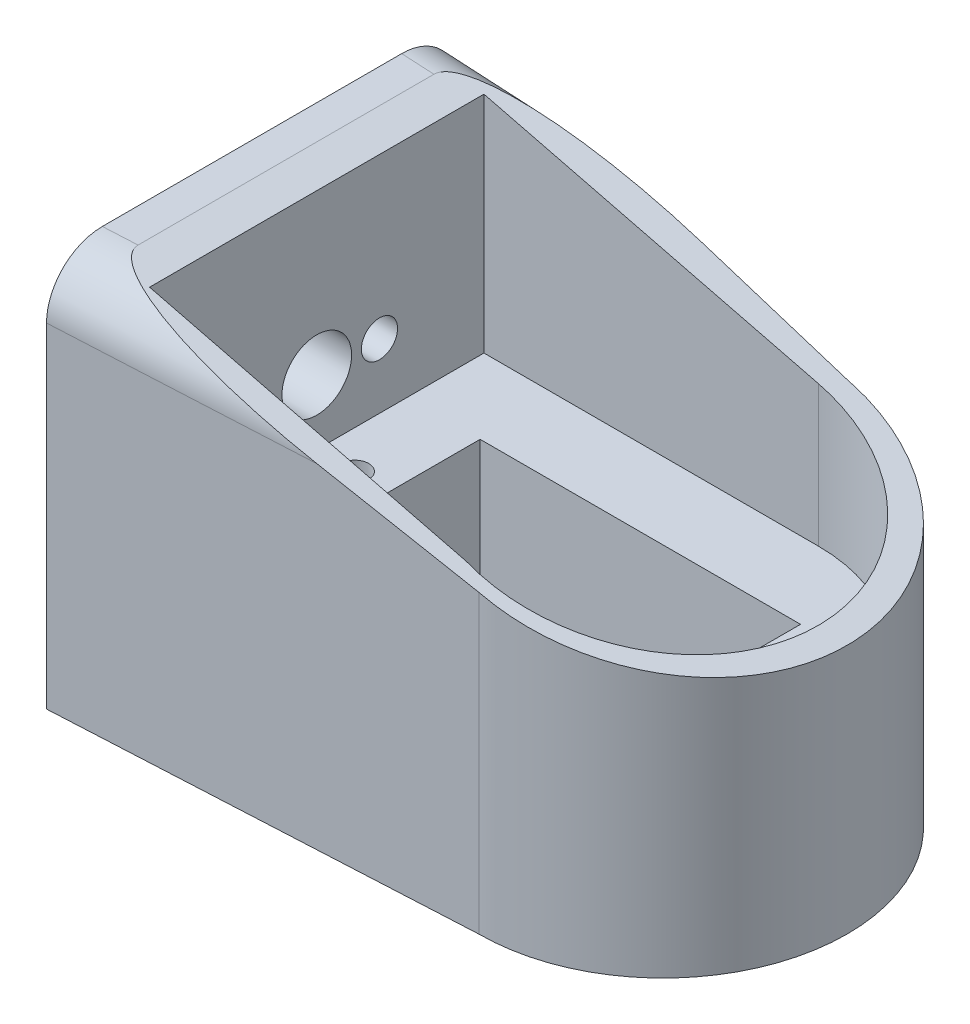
ISO-10303-21;
HEADER;
FILE_DESCRIPTION(('STEP AP214'),'2;1');
FILE_NAME('part.step','',(''),(''),'','','');
FILE_SCHEMA(('AUTOMOTIVE_DESIGN { 1 0 10303 214 1 1 1 1 }'));
ENDSEC;
DATA;
#1=APPLICATION_CONTEXT('core data for automotive mechanical design processes');
#2=APPLICATION_PROTOCOL_DEFINITION('international standard','automotive_design',2000,#1);
#3=PRODUCT_CONTEXT('',#1,'mechanical');
#4=PRODUCT('Part','Part','',(#3));
#5=PRODUCT_RELATED_PRODUCT_CATEGORY('part','',(#4));
#6=PRODUCT_DEFINITION_FORMATION('','',#4);
#7=PRODUCT_DEFINITION_CONTEXT('part definition',#1,'design');
#8=PRODUCT_DEFINITION('design','',#6,#7);
#9=PRODUCT_DEFINITION_SHAPE('','',#8);
#10=(LENGTH_UNIT() NAMED_UNIT(*) SI_UNIT(.MILLI.,.METRE.));
#11=(NAMED_UNIT(*) PLANE_ANGLE_UNIT() SI_UNIT($,.RADIAN.));
#12=(NAMED_UNIT(*) SI_UNIT($,.STERADIAN.) SOLID_ANGLE_UNIT());
#13=UNCERTAINTY_MEASURE_WITH_UNIT(LENGTH_MEASURE(1.E-05),#10,'distance_accuracy_value','');
#14=(GEOMETRIC_REPRESENTATION_CONTEXT(3) GLOBAL_UNCERTAINTY_ASSIGNED_CONTEXT((#13)) GLOBAL_UNIT_ASSIGNED_CONTEXT((#10,
#11,#12)) REPRESENTATION_CONTEXT('',''));
#15=CARTESIAN_POINT('',(0.,0.,0.));
#16=DIRECTION('',(0.,0.,1.));
#17=DIRECTION('',(1.,0.,0.));
#18=AXIS2_PLACEMENT_3D('',#15,#16,#17);
#19=CARTESIAN_POINT('',(-0.930747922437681,28.,29.5));
#20=DIRECTION('',(0.,-1.,0.));
#21=DIRECTION('',(0.,0.,-1.));
#22=AXIS2_PLACEMENT_3D('',#19,#20,#21);
#23=PLANE('',#22);
#24=DIRECTION('',(0.,0.,-1.));
#25=VECTOR('',#24,1.);
#26=CARTESIAN_POINT('',(1.50847437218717,28.,42.));
#27=LINE('',#26,#25);
#28=CARTESIAN_POINT('',(1.50847437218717,28.,25.3681149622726));
#29=VERTEX_POINT('',#28);
#30=CARTESIAN_POINT('',(1.50847437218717,28.,4.13188503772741));
#31=VERTEX_POINT('',#30);
#32=EDGE_CURVE('E257',#29,#31,#27,.T.);
#33=ORIENTED_EDGE('',*,*,#32,.T.);
#34=DIRECTION('',(-0.998657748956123,0.,-0.0517947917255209));
#35=VECTOR('',#34,1.);
#36=CARTESIAN_POINT('',(0.387968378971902,28.,4.07377065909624));
#37=LINE('',#36,#35);
#38=CARTESIAN_POINT('',(-0.930747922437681,28.,4.00537622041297));
#39=VERTEX_POINT('',#38);
#40=EDGE_CURVE('E241',#31,#39,#37,.T.);
#41=ORIENTED_EDGE('',*,*,#40,.T.);
#42=DIRECTION('',(0.,0.,-1.));
#43=VECTOR('',#42,1.);
#44=CARTESIAN_POINT('',(-0.930747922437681,28.,29.5));
#45=LINE('',#44,#43);
#46=CARTESIAN_POINT('',(-0.930747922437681,28.,25.494623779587));
#47=VERTEX_POINT('',#46);
#48=EDGE_CURVE('E223',#47,#39,#45,.T.);
#49=ORIENTED_EDGE('',*,*,#48,.F.);
#50=DIRECTION('',(0.998657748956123,0.,-0.0517947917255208));
#51=VECTOR('',#50,1.);
#52=CARTESIAN_POINT('',(-1.13792708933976,28.,25.5053690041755));
#53=LINE('',#52,#51);
#54=EDGE_CURVE('E170',#47,#29,#53,.T.);
#55=ORIENTED_EDGE('',*,*,#54,.T.);
#56=EDGE_LOOP('',(#33,#41,#49,#55));
#57=FACE_BOUND('',#56,.T.);
#58=ADVANCED_FACE('F45',(#57),#23,.F.);
#59=CARTESIAN_POINT('',(28.5692520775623,29.5,1.53));
#60=DIRECTION('',(-0.0517947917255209,0.,0.998657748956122));
#61=DIRECTION('',(0.998657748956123,0.,0.0517947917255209));
#62=AXIS2_PLACEMENT_3D('',#59,#60,#61);
#63=PLANE('',#62);
#64=DIRECTION('',(0.,-1.,0.));
#65=VECTOR('',#64,1.);
#66=CARTESIAN_POINT('',(-0.930747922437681,0.,0.));
#67=LINE('',#66,#65);
#68=CARTESIAN_POINT('',(-0.930747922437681,24.,0.));
#69=VERTEX_POINT('',#68);
#70=CARTESIAN_POINT('',(-0.930747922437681,0.,0.));
#71=VERTEX_POINT('',#70);
#72=EDGE_CURVE('E214',#69,#71,#67,.T.);
#73=ORIENTED_EDGE('',*,*,#72,.F.);
#74=DIRECTION('',(-0.998657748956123,0.,-0.0517947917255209));
#75=VECTOR('',#74,1.);
#76=CARTESIAN_POINT('',(28.5692520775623,24.,1.53));
#77=LINE('',#76,#75);
#78=CARTESIAN_POINT('',(17.5352920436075,24.,0.957730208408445));
#79=VERTEX_POINT('',#78);
#80=EDGE_CURVE('E69',#69,#79,#77,.F.);
#81=ORIENTED_EDGE('',*,*,#80,.T.);
#82=DIRECTION('',(-0.969011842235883,0.241847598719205,-0.0502572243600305));
#83=VECTOR('',#82,1.);
#84=CARTESIAN_POINT('',(26.6349303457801,21.7288970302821,1.42967755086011));
#85=LINE('',#84,#83);
#86=CARTESIAN_POINT('',(28.5692520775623,21.2461257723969,1.53));
#87=VERTEX_POINT('',#86);
#88=EDGE_CURVE('E258',#87,#79,#85,.T.);
#89=ORIENTED_EDGE('',*,*,#88,.F.);
#90=DIRECTION('',(0.,-1.,0.));
#91=VECTOR('',#90,1.);
#92=CARTESIAN_POINT('',(28.5692520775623,29.5,1.53));
#93=LINE('',#92,#91);
#94=CARTESIAN_POINT('',(28.5692520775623,0.,1.53));
#95=VERTEX_POINT('',#94);
#96=EDGE_CURVE('E205',#87,#95,#93,.T.);
#97=ORIENTED_EDGE('',*,*,#96,.T.);
#98=DIRECTION('',(-0.998657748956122,0.,-0.0517947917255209));
#99=VECTOR('',#98,1.);
#100=CARTESIAN_POINT('',(28.5692520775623,0.,1.53));
#101=LINE('',#100,#99);
#102=EDGE_CURVE('E211',#95,#71,#101,.T.);
#103=ORIENTED_EDGE('',*,*,#102,.T.);
#104=EDGE_LOOP('',(#73,#81,#89,#97,#103));
#105=FACE_BOUND('',#104,.T.);
#106=ADVANCED_FACE('F270',(#105),#63,.F.);
#107=CARTESIAN_POINT('',(-0.930747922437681,29.5,29.5));
#108=DIRECTION('',(-0.0517947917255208,0.,-0.998657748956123));
#109=DIRECTION('',(-0.998657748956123,0.,0.0517947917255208));
#110=AXIS2_PLACEMENT_3D('',#107,#108,#109);
#111=PLANE('',#110);
#112=DIRECTION('',(0.969011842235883,-0.241847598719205,-0.0502572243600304));
#113=VECTOR('',#112,1.);
#114=CARTESIAN_POINT('',(-1.13960695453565,28.6609125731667,29.5108323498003));
#115=LINE('',#114,#113);
#116=CARTESIAN_POINT('',(17.5352920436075,24.,28.5422697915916));
#117=VERTEX_POINT('',#116);
#118=CARTESIAN_POINT('',(28.5692520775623,21.2461257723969,27.97));
#119=VERTEX_POINT('',#118);
#120=EDGE_CURVE('E284',#117,#119,#115,.T.);
#121=ORIENTED_EDGE('',*,*,#120,.F.);
#122=DIRECTION('',(0.998657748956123,0.,-0.0517947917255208));
#123=VECTOR('',#122,1.);
#124=CARTESIAN_POINT('',(-0.930747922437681,24.,29.5));
#125=LINE('',#124,#123);
#126=CARTESIAN_POINT('',(-0.930747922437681,24.,29.5));
#127=VERTEX_POINT('',#126);
#128=EDGE_CURVE('E11',#117,#127,#125,.F.);
#129=ORIENTED_EDGE('',*,*,#128,.T.);
#130=DIRECTION('',(0.,-1.,0.));
#131=VECTOR('',#130,1.);
#132=CARTESIAN_POINT('',(-0.930747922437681,0.,29.5));
#133=LINE('',#132,#131);
#134=CARTESIAN_POINT('',(-0.930747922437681,0.,29.5));
#135=VERTEX_POINT('',#134);
#136=EDGE_CURVE('E220',#127,#135,#133,.T.);
#137=ORIENTED_EDGE('',*,*,#136,.T.);
#138=DIRECTION('',(0.998657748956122,0.,-0.0517947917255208));
#139=VECTOR('',#138,1.);
#140=CARTESIAN_POINT('',(-0.930747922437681,0.,29.5));
#141=LINE('',#140,#139);
#142=CARTESIAN_POINT('',(28.5692520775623,0.,27.97));
#143=VERTEX_POINT('',#142);
#144=EDGE_CURVE('E206',#135,#143,#141,.T.);
#145=ORIENTED_EDGE('',*,*,#144,.T.);
#146=DIRECTION('',(0.,-1.,0.));
#147=VECTOR('',#146,1.);
#148=CARTESIAN_POINT('',(28.5692520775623,29.5,27.97));
#149=LINE('',#148,#147);
#150=EDGE_CURVE('E210',#119,#143,#149,.T.);
#151=ORIENTED_EDGE('',*,*,#150,.F.);
#152=EDGE_LOOP('',(#121,#129,#137,#145,#151));
#153=FACE_BOUND('',#152,.T.);
#154=ADVANCED_FACE('F282',(#153),#111,.F.);
#155=CARTESIAN_POINT('',(28.5692520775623,57.5608186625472,14.75));
#156=DIRECTION('',(0.,-1.,0.));
#157=DIRECTION('',(0.,0.,-1.));
#158=AXIS2_PLACEMENT_3D('',#155,#156,#157);
#159=CYLINDRICAL_SURFACE('',#158,13.22);
#160=ORIENTED_EDGE('',*,*,#96,.F.);
#161=CARTESIAN_POINT('',(28.5692520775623,21.2461257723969,14.75));
#162=DIRECTION('',(0.242153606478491,0.970237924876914,0.));
#163=DIRECTION('',(0.970237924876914,-0.242153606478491,0.));
#164=AXIS2_PLACEMENT_3D('',#161,#162,#163);
#165=ELLIPSE('',#164,13.6255238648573,13.22);
#166=EDGE_CURVE('E181',#87,#119,#165,.F.);
#167=ORIENTED_EDGE('',*,*,#166,.T.);
#168=ORIENTED_EDGE('',*,*,#150,.T.);
#169=CARTESIAN_POINT('',(28.5692520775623,0.,14.75));
#170=DIRECTION('',(0.,-1.,0.));
#171=DIRECTION('',(0.,0.,-1.));
#172=AXIS2_PLACEMENT_3D('',#169,#170,#171);
#173=CIRCLE('',#172,13.22);
#174=EDGE_CURVE('E201',#95,#143,#173,.T.);
#175=ORIENTED_EDGE('',*,*,#174,.F.);
#176=EDGE_LOOP('',(#160,#167,#168,#175));
#177=FACE_BOUND('',#176,.T.);
#178=ADVANCED_FACE('F460',(#177),#159,.T.);
#179=CARTESIAN_POINT('',(3.9346184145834,11.3,2.96778633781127));
#180=DIRECTION('',(0.,0.,-1.));
#181=DIRECTION('',(-1.,0.,0.));
#182=AXIS2_PLACEMENT_3D('',#179,#180,#181);
#183=PLANE('',#182);
#184=DIRECTION('',(0.970237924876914,-0.242153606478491,0.));
#185=VECTOR('',#184,1.);
#186=CARTESIAN_POINT('',(7.71596171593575,26.4507249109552,2.96778633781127));
#187=LINE('',#186,#185);
#188=CARTESIAN_POINT('',(3.9346184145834,27.3944789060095,2.96778633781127));
#189=VERTEX_POINT('',#188);
#190=CARTESIAN_POINT('',(27.9346184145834,21.4045187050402,2.96778633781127));
#191=VERTEX_POINT('',#190);
#192=EDGE_CURVE('E162',#189,#191,#187,.T.);
#193=ORIENTED_EDGE('',*,*,#192,.F.);
#194=DIRECTION('',(0.,1.,0.));
#195=VECTOR('',#194,1.);
#196=CARTESIAN_POINT('',(3.9346184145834,11.3,2.96778633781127));
#197=LINE('',#196,#195);
#198=CARTESIAN_POINT('',(3.9346184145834,11.3,2.96778633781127));
#199=VERTEX_POINT('',#198);
#200=EDGE_CURVE('E177',#199,#189,#197,.T.);
#201=ORIENTED_EDGE('',*,*,#200,.F.);
#202=DIRECTION('',(-1.,0.,0.));
#203=VECTOR('',#202,1.);
#204=CARTESIAN_POINT('',(3.9346184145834,11.3,2.96778633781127));
#205=LINE('',#204,#203);
#206=CARTESIAN_POINT('',(27.9346184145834,11.3,2.96778633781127));
#207=VERTEX_POINT('',#206);
#208=EDGE_CURVE('E372',#207,#199,#205,.T.);
#209=ORIENTED_EDGE('',*,*,#208,.F.);
#210=DIRECTION('',(0.,1.,0.));
#211=VECTOR('',#210,1.);
#212=CARTESIAN_POINT('',(27.9346184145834,11.3,2.96778633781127));
#213=LINE('',#212,#211);
#214=EDGE_CURVE('E179',#207,#191,#213,.T.);
#215=ORIENTED_EDGE('',*,*,#214,.T.);
#216=EDGE_LOOP('',(#193,#201,#209,#215));
#217=FACE_BOUND('',#216,.T.);
#218=ADVANCED_FACE('F175',(#217),#183,.F.);
#219=CARTESIAN_POINT('',(27.9346184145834,11.3,15.0027263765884));
#220=DIRECTION('',(0.,1.,0.));
#221=DIRECTION('',(0.,0.,1.));
#222=AXIS2_PLACEMENT_3D('',#219,#220,#221);
#223=CYLINDRICAL_SURFACE('',#222,12.0349400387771);
#224=CARTESIAN_POINT('',(27.9346184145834,21.4045187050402,15.0027263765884));
#225=DIRECTION('',(0.242153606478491,0.970237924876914,0.));
#226=DIRECTION('',(-0.970237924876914,0.242153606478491,0.));
#227=AXIS2_PLACEMENT_3D('',#224,#225,#226);
#228=ELLIPSE('',#227,12.4041121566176,12.0349400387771);
#229=CARTESIAN_POINT('',(26.6395810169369,21.7277363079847,26.9677863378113));
#230=VERTEX_POINT('',#229);
#231=EDGE_CURVE('E182',#191,#230,#228,.F.);
#232=ORIENTED_EDGE('',*,*,#231,.F.);
#233=ORIENTED_EDGE('',*,*,#214,.F.);
#234=CARTESIAN_POINT('',(27.9346184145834,11.3,15.0027263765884));
#235=DIRECTION('',(0.,1.,0.));
#236=DIRECTION('',(0.,0.,-1.));
#237=AXIS2_PLACEMENT_3D('',#234,#235,#236);
#238=CIRCLE('',#237,12.0349400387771);
#239=CARTESIAN_POINT('',(26.6395810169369,11.3,26.9677863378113));
#240=VERTEX_POINT('',#239);
#241=EDGE_CURVE('E190',#240,#207,#238,.T.);
#242=ORIENTED_EDGE('',*,*,#241,.F.);
#243=DIRECTION('',(0.,1.,0.));
#244=VECTOR('',#243,1.);
#245=CARTESIAN_POINT('',(26.6395810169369,11.3,26.9677863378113));
#246=LINE('',#245,#244);
#247=EDGE_CURVE('E194',#240,#230,#246,.T.);
#248=ORIENTED_EDGE('',*,*,#247,.T.);
#249=EDGE_LOOP('',(#232,#233,#242,#248));
#250=FACE_BOUND('',#249,.T.);
#251=ADVANCED_FACE('F394',(#250),#223,.F.);
#252=CARTESIAN_POINT('',(3.9346184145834,11.3,26.9677863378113));
#253=DIRECTION('',(0.,0.,1.));
#254=DIRECTION('',(1.,0.,0.));
#255=AXIS2_PLACEMENT_3D('',#252,#253,#254);
#256=PLANE('',#255);
#257=DIRECTION('',(-0.970237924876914,0.242153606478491,0.));
#258=VECTOR('',#257,1.);
#259=CARTESIAN_POINT('',(7.71596171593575,26.4507249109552,26.9677863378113));
#260=LINE('',#259,#258);
#261=CARTESIAN_POINT('',(3.9346184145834,27.3944789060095,26.9677863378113));
#262=VERTEX_POINT('',#261);
#263=EDGE_CURVE('E165',#230,#262,#260,.T.);
#264=ORIENTED_EDGE('',*,*,#263,.F.);
#265=ORIENTED_EDGE('',*,*,#247,.F.);
#266=DIRECTION('',(1.,0.,0.));
#267=VECTOR('',#266,1.);
#268=CARTESIAN_POINT('',(3.9346184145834,11.3,26.9677863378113));
#269=LINE('',#268,#267);
#270=CARTESIAN_POINT('',(3.9346184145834,11.3,26.9677863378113));
#271=VERTEX_POINT('',#270);
#272=EDGE_CURVE('E197',#271,#240,#269,.T.);
#273=ORIENTED_EDGE('',*,*,#272,.F.);
#274=DIRECTION('',(0.,1.,0.));
#275=VECTOR('',#274,1.);
#276=CARTESIAN_POINT('',(3.9346184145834,11.3,26.9677863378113));
#277=LINE('',#276,#275);
#278=EDGE_CURVE('E189',#271,#262,#277,.T.);
#279=ORIENTED_EDGE('',*,*,#278,.T.);
#280=EDGE_LOOP('',(#264,#265,#273,#279));
#281=FACE_BOUND('',#280,.T.);
#282=ADVANCED_FACE('F397',(#281),#256,.F.);
#283=CARTESIAN_POINT('',(3.9346184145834,11.3,2.96778633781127));
#284=DIRECTION('',(-1.,0.,0.));
#285=DIRECTION('',(0.,0.,1.));
#286=AXIS2_PLACEMENT_3D('',#283,#284,#285);
#287=PLANE('',#286);
#288=CARTESIAN_POINT('',(3.9346184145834,15.9366349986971,14.9677863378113));
#289=DIRECTION('',(1.,0.,0.));
#290=DIRECTION('',(0.,0.,-1.));
#291=AXIS2_PLACEMENT_3D('',#288,#289,#290);
#292=CIRCLE('',#291,2.5);
#293=CARTESIAN_POINT('',(3.9346184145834,15.9366349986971,12.4677863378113));
#294=VERTEX_POINT('',#293);
#295=EDGE_CURVE('E298',#294,#294,#292,.T.);
#296=ORIENTED_EDGE('',*,*,#295,.F.);
#297=EDGE_LOOP('',(#296));
#298=FACE_BOUND('',#297,.T.);
#299=CARTESIAN_POINT('',(3.9346184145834,15.9366349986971,10.4677863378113));
#300=DIRECTION('',(1.,0.,0.));
#301=DIRECTION('',(0.,0.,-1.));
#302=AXIS2_PLACEMENT_3D('',#299,#300,#301);
#303=CIRCLE('',#302,1.3);
#304=CARTESIAN_POINT('',(3.9346184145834,15.9366349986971,9.16778633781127));
#305=VERTEX_POINT('',#304);
#306=EDGE_CURVE('E294',#305,#305,#303,.T.);
#307=ORIENTED_EDGE('',*,*,#306,.F.);
#308=EDGE_LOOP('',(#307));
#309=FACE_BOUND('',#308,.T.);
#310=CARTESIAN_POINT('',(3.9346184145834,15.9366349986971,19.4677863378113));
#311=DIRECTION('',(1.,0.,0.));
#312=DIRECTION('',(0.,0.,-1.));
#313=AXIS2_PLACEMENT_3D('',#310,#311,#312);
#314=CIRCLE('',#313,1.3);
#315=CARTESIAN_POINT('',(3.9346184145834,15.9366349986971,18.1677863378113));
#316=VERTEX_POINT('',#315);
#317=EDGE_CURVE('E290',#316,#316,#314,.T.);
#318=ORIENTED_EDGE('',*,*,#317,.F.);
#319=EDGE_LOOP('',(#318));
#320=FACE_BOUND('',#319,.T.);
#321=DIRECTION('',(0.,0.,-1.));
#322=VECTOR('',#321,1.);
#323=CARTESIAN_POINT('',(3.9346184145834,27.3944789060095,2.96778633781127));
#324=LINE('',#323,#322);
#325=EDGE_CURVE('E159',#262,#189,#324,.T.);
#326=ORIENTED_EDGE('',*,*,#325,.F.);
#327=ORIENTED_EDGE('',*,*,#278,.F.);
#328=DIRECTION('',(0.,0.,1.));
#329=VECTOR('',#328,1.);
#330=CARTESIAN_POINT('',(3.9346184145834,11.3,2.96778633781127));
#331=LINE('',#330,#329);
#332=EDGE_CURVE('E186',#199,#271,#331,.T.);
#333=ORIENTED_EDGE('',*,*,#332,.F.);
#334=ORIENTED_EDGE('',*,*,#200,.T.);
#335=EDGE_LOOP('',(#326,#327,#333,#334));
#336=FACE_BOUND('',#335,.T.);
#337=ADVANCED_FACE('F184',(#298,#309,#320,#336),#287,.F.);
#338=CARTESIAN_POINT('',(0.,2.3,0.));
#339=DIRECTION('',(0.,1.,0.));
#340=DIRECTION('',(0.,0.,1.));
#341=AXIS2_PLACEMENT_3D('',#338,#339,#340);
#342=PLANE('',#341);
#343=CARTESIAN_POINT('',(25.159431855,2.3,14.9677863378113));
#344=DIRECTION('',(0.,1.,0.));
#345=DIRECTION('',(0.,0.,1.));
#346=AXIS2_PLACEMENT_3D('',#343,#344,#345);
#347=CIRCLE('',#346,6.5);
#348=CARTESIAN_POINT('',(25.159431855,2.3,21.4677863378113));
#349=VERTEX_POINT('',#348);
#350=CARTESIAN_POINT('',(25.159431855,2.3,8.46778633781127));
#351=VERTEX_POINT('',#350);
#352=EDGE_CURVE('E236',#349,#351,#347,.T.);
#353=ORIENTED_EDGE('',*,*,#352,.F.);
#354=DIRECTION('',(1.,0.,0.));
#355=VECTOR('',#354,1.);
#356=CARTESIAN_POINT('',(9.15943185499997,2.3,21.4677863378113));
#357=LINE('',#356,#355);
#358=CARTESIAN_POINT('',(32.159431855,2.3,21.4677863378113));
#359=VERTEX_POINT('',#358);
#360=EDGE_CURVE('E350',#349,#359,#357,.T.);
#361=ORIENTED_EDGE('',*,*,#360,.T.);
#362=DIRECTION('',(0.,0.,-1.));
#363=VECTOR('',#362,1.);
#364=CARTESIAN_POINT('',(32.159431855,2.3,8.46778633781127));
#365=LINE('',#364,#363);
#366=CARTESIAN_POINT('',(32.159431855,2.3,8.46778633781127));
#367=VERTEX_POINT('',#366);
#368=EDGE_CURVE('E336',#359,#367,#365,.T.);
#369=ORIENTED_EDGE('',*,*,#368,.T.);
#370=DIRECTION('',(-1.,0.,0.));
#371=VECTOR('',#370,1.);
#372=CARTESIAN_POINT('',(9.15943185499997,2.3,8.46778633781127));
#373=LINE('',#372,#371);
#374=EDGE_CURVE('E342',#367,#351,#373,.T.);
#375=ORIENTED_EDGE('',*,*,#374,.T.);
#376=EDGE_LOOP('',(#353,#361,#369,#375));
#377=FACE_BOUND('',#376,.T.);
#378=ADVANCED_FACE('F402',(#377),#342,.T.);
#379=CARTESIAN_POINT('',(27.9346184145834,11.3,15.0027263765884));
#380=DIRECTION('',(0.,-1.,0.));
#381=DIRECTION('',(0.,0.,-1.));
#382=AXIS2_PLACEMENT_3D('',#379,#380,#381);
#383=PLANE('',#382);
#384=CARTESIAN_POINT('',(6.65943185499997,11.3,14.9677863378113));
#385=DIRECTION('',(0.,1.,0.));
#386=DIRECTION('',(0.,0.,1.));
#387=AXIS2_PLACEMENT_3D('',#384,#385,#386);
#388=CIRCLE('',#387,1.);
#389=CARTESIAN_POINT('',(6.65943185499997,11.3,15.9677863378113));
#390=VERTEX_POINT('',#389);
#391=EDGE_CURVE('E325',#390,#390,#388,.T.);
#392=ORIENTED_EDGE('',*,*,#391,.F.);
#393=EDGE_LOOP('',(#392));
#394=FACE_BOUND('',#393,.T.);
#395=CARTESIAN_POINT('',(34.659431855,11.3,14.9677863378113));
#396=DIRECTION('',(0.,1.,0.));
#397=DIRECTION('',(0.,0.,1.));
#398=AXIS2_PLACEMENT_3D('',#395,#396,#397);
#399=CIRCLE('',#398,0.999999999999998);
#400=CARTESIAN_POINT('',(34.659431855,11.3,15.9677863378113));
#401=VERTEX_POINT('',#400);
#402=EDGE_CURVE('E329',#401,#401,#399,.T.);
#403=ORIENTED_EDGE('',*,*,#402,.F.);
#404=EDGE_LOOP('',(#403));
#405=FACE_BOUND('',#404,.T.);
#406=ORIENTED_EDGE('',*,*,#208,.T.);
#407=ORIENTED_EDGE('',*,*,#332,.T.);
#408=ORIENTED_EDGE('',*,*,#272,.T.);
#409=ORIENTED_EDGE('',*,*,#241,.T.);
#410=EDGE_LOOP('',(#406,#407,#408,#409));
#411=FACE_BOUND('',#410,.T.);
#412=DIRECTION('',(0.,0.,-1.));
#413=VECTOR('',#412,1.);
#414=CARTESIAN_POINT('',(32.159431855,11.3,8.46778633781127));
#415=LINE('',#414,#413);
#416=CARTESIAN_POINT('',(32.159431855,11.3,21.4677863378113));
#417=VERTEX_POINT('',#416);
#418=CARTESIAN_POINT('',(32.159431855,11.3,8.46778633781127));
#419=VERTEX_POINT('',#418);
#420=EDGE_CURVE('E324',#417,#419,#415,.T.);
#421=ORIENTED_EDGE('',*,*,#420,.F.);
#422=DIRECTION('',(1.,0.,0.));
#423=VECTOR('',#422,1.);
#424=CARTESIAN_POINT('',(9.15943185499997,11.3,21.4677863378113));
#425=LINE('',#424,#423);
#426=CARTESIAN_POINT('',(9.15943185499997,11.3,21.4677863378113));
#427=VERTEX_POINT('',#426);
#428=EDGE_CURVE('E341',#427,#417,#425,.T.);
#429=ORIENTED_EDGE('',*,*,#428,.F.);
#430=DIRECTION('',(0.,0.,1.));
#431=VECTOR('',#430,1.);
#432=CARTESIAN_POINT('',(9.15943185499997,11.3,8.46778633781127));
#433=LINE('',#432,#431);
#434=CARTESIAN_POINT('',(9.15943185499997,11.3,8.46778633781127));
#435=VERTEX_POINT('',#434);
#436=EDGE_CURVE('E363',#435,#427,#433,.T.);
#437=ORIENTED_EDGE('',*,*,#436,.F.);
#438=DIRECTION('',(-1.,0.,0.));
#439=VECTOR('',#438,1.);
#440=CARTESIAN_POINT('',(9.15943185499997,11.3,8.46778633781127));
#441=LINE('',#440,#439);
#442=EDGE_CURVE('E359',#419,#435,#441,.T.);
#443=ORIENTED_EDGE('',*,*,#442,.F.);
#444=EDGE_LOOP('',(#421,#429,#437,#443));
#445=FACE_BOUND('',#444,.T.);
#446=ADVANCED_FACE('F399',(#394,#405,#411,#445),#383,.F.);
#447=CARTESIAN_POINT('',(-0.930747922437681,0.,29.5));
#448=DIRECTION('',(1.,0.,0.));
#449=DIRECTION('',(0.,0.,-1.));
#450=AXIS2_PLACEMENT_3D('',#447,#448,#449);
#451=PLANE('',#450);
#452=CARTESIAN_POINT('',(-0.930747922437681,15.9366349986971,19.4677863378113));
#453=DIRECTION('',(1.,0.,0.));
#454=DIRECTION('',(0.,0.,-1.));
#455=AXIS2_PLACEMENT_3D('',#452,#453,#454);
#456=CIRCLE('',#455,1.3);
#457=CARTESIAN_POINT('',(-0.930747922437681,15.9366349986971,18.1677863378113));
#458=VERTEX_POINT('',#457);
#459=EDGE_CURVE('E313',#458,#458,#456,.T.);
#460=ORIENTED_EDGE('',*,*,#459,.T.);
#461=EDGE_LOOP('',(#460));
#462=FACE_BOUND('',#461,.T.);
#463=CARTESIAN_POINT('',(-0.930747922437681,15.9366349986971,10.4677863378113));
#464=DIRECTION('',(1.,0.,0.));
#465=DIRECTION('',(0.,0.,-1.));
#466=AXIS2_PLACEMENT_3D('',#463,#464,#465);
#467=CIRCLE('',#466,1.3);
#468=CARTESIAN_POINT('',(-0.930747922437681,15.9366349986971,9.16778633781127));
#469=VERTEX_POINT('',#468);
#470=EDGE_CURVE('E309',#469,#469,#467,.T.);
#471=ORIENTED_EDGE('',*,*,#470,.T.);
#472=EDGE_LOOP('',(#471));
#473=FACE_BOUND('',#472,.T.);
#474=CARTESIAN_POINT('',(-0.930747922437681,15.9366349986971,14.9677863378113));
#475=DIRECTION('',(1.,0.,0.));
#476=DIRECTION('',(0.,0.,-1.));
#477=AXIS2_PLACEMENT_3D('',#474,#475,#476);
#478=CIRCLE('',#477,2.5);
#479=CARTESIAN_POINT('',(-0.930747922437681,15.9366349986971,12.4677863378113));
#480=VERTEX_POINT('',#479);
#481=EDGE_CURVE('E305',#480,#480,#478,.T.);
#482=ORIENTED_EDGE('',*,*,#481,.T.);
#483=EDGE_LOOP('',(#482));
#484=FACE_BOUND('',#483,.T.);
#485=ORIENTED_EDGE('',*,*,#48,.T.);
#486=CARTESIAN_POINT('',(-0.930747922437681,24.,4.00537622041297));
#487=DIRECTION('',(1.,0.,0.));
#488=DIRECTION('',(0.,0.,-1.));
#489=AXIS2_PLACEMENT_3D('',#486,#487,#488);
#490=ELLIPSE('',#489,4.00537622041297,4.);
#491=EDGE_CURVE('E248',#39,#69,#490,.F.);
#492=ORIENTED_EDGE('',*,*,#491,.T.);
#493=ORIENTED_EDGE('',*,*,#72,.T.);
#494=DIRECTION('',(0.,0.,-1.));
#495=VECTOR('',#494,1.);
#496=CARTESIAN_POINT('',(-0.930747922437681,0.,29.5));
#497=LINE('',#496,#495);
#498=EDGE_CURVE('E171',#135,#71,#497,.T.);
#499=ORIENTED_EDGE('',*,*,#498,.F.);
#500=ORIENTED_EDGE('',*,*,#136,.F.);
#501=CARTESIAN_POINT('',(-0.930747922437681,24.,25.494623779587));
#502=DIRECTION('',(1.,0.,0.));
#503=DIRECTION('',(0.,0.,-1.));
#504=AXIS2_PLACEMENT_3D('',#501,#502,#503);
#505=ELLIPSE('',#504,4.00537622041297,4.);
#506=EDGE_CURVE('E245',#127,#47,#505,.F.);
#507=ORIENTED_EDGE('',*,*,#506,.T.);
#508=EDGE_LOOP('',(#485,#492,#493,#499,#500,#507));
#509=FACE_BOUND('',#508,.T.);
#510=ADVANCED_FACE('F268',(#462,#473,#484,#509),#451,.F.);
#511=CARTESIAN_POINT('',(-0.930747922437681,0.,29.5));
#512=DIRECTION('',(0.,1.,0.));
#513=DIRECTION('',(0.,0.,1.));
#514=AXIS2_PLACEMENT_3D('',#511,#512,#513);
#515=PLANE('',#514);
#516=CARTESIAN_POINT('',(25.159431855,0.,14.9677863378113));
#517=DIRECTION('',(0.,1.,0.));
#518=DIRECTION('',(0.,0.,1.));
#519=AXIS2_PLACEMENT_3D('',#516,#517,#518);
#520=CIRCLE('',#519,6.5);
#521=CARTESIAN_POINT('',(25.159431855,0.,21.4677863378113));
#522=VERTEX_POINT('',#521);
#523=EDGE_CURVE('E232',#522,#522,#520,.T.);
#524=ORIENTED_EDGE('',*,*,#523,.T.);
#525=EDGE_LOOP('',(#524));
#526=FACE_BOUND('',#525,.T.);
#527=ORIENTED_EDGE('',*,*,#102,.F.);
#528=ORIENTED_EDGE('',*,*,#174,.T.);
#529=ORIENTED_EDGE('',*,*,#144,.F.);
#530=ORIENTED_EDGE('',*,*,#498,.T.);
#531=EDGE_LOOP('',(#527,#528,#529,#530));
#532=FACE_BOUND('',#531,.T.);
#533=ADVANCED_FACE('F276',(#526,#532),#515,.F.);
#534=CARTESIAN_POINT('',(32.159431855,2.3,8.46778633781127));
#535=DIRECTION('',(1.,0.,0.));
#536=DIRECTION('',(0.,0.,-1.));
#537=AXIS2_PLACEMENT_3D('',#534,#535,#536);
#538=PLANE('',#537);
#539=ORIENTED_EDGE('',*,*,#420,.T.);
#540=DIRECTION('',(0.,1.,0.));
#541=VECTOR('',#540,1.);
#542=CARTESIAN_POINT('',(32.159431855,2.3,8.46778633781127));
#543=LINE('',#542,#541);
#544=EDGE_CURVE('E355',#367,#419,#543,.T.);
#545=ORIENTED_EDGE('',*,*,#544,.F.);
#546=ORIENTED_EDGE('',*,*,#368,.F.);
#547=DIRECTION('',(0.,1.,0.));
#548=VECTOR('',#547,1.);
#549=CARTESIAN_POINT('',(32.159431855,2.3,21.4677863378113));
#550=LINE('',#549,#548);
#551=EDGE_CURVE('E369',#359,#417,#550,.T.);
#552=ORIENTED_EDGE('',*,*,#551,.T.);
#553=EDGE_LOOP('',(#539,#545,#546,#552));
#554=FACE_BOUND('',#553,.T.);
#555=ADVANCED_FACE('F410',(#554),#538,.F.);
#556=CARTESIAN_POINT('',(9.15943185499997,2.3,21.4677863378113));
#557=DIRECTION('',(0.,0.,1.));
#558=DIRECTION('',(1.,0.,0.));
#559=AXIS2_PLACEMENT_3D('',#556,#557,#558);
#560=PLANE('',#559);
#561=ORIENTED_EDGE('',*,*,#428,.T.);
#562=ORIENTED_EDGE('',*,*,#551,.F.);
#563=ORIENTED_EDGE('',*,*,#360,.F.);
#564=CARTESIAN_POINT('',(9.15943185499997,2.3,21.4677863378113));
#565=VERTEX_POINT('',#564);
#566=EDGE_CURVE('E351',#565,#349,#357,.T.);
#567=ORIENTED_EDGE('',*,*,#566,.F.);
#568=DIRECTION('',(0.,1.,0.));
#569=VECTOR('',#568,1.);
#570=CARTESIAN_POINT('',(9.15943185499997,2.3,21.4677863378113));
#571=LINE('',#570,#569);
#572=EDGE_CURVE('E373',#565,#427,#571,.T.);
#573=ORIENTED_EDGE('',*,*,#572,.T.);
#574=EDGE_LOOP('',(#561,#562,#563,#567,#573));
#575=FACE_BOUND('',#574,.T.);
#576=ADVANCED_FACE('F416',(#575),#560,.F.);
#577=CARTESIAN_POINT('',(9.15943185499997,2.3,8.46778633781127));
#578=DIRECTION('',(-1.,0.,0.));
#579=DIRECTION('',(0.,0.,1.));
#580=AXIS2_PLACEMENT_3D('',#577,#578,#579);
#581=PLANE('',#580);
#582=ORIENTED_EDGE('',*,*,#436,.T.);
#583=ORIENTED_EDGE('',*,*,#572,.F.);
#584=DIRECTION('',(0.,0.,1.));
#585=VECTOR('',#584,1.);
#586=CARTESIAN_POINT('',(9.15943185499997,2.3,8.46778633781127));
#587=LINE('',#586,#585);
#588=CARTESIAN_POINT('',(9.15943185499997,2.3,8.46778633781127));
#589=VERTEX_POINT('',#588);
#590=EDGE_CURVE('E346',#589,#565,#587,.T.);
#591=ORIENTED_EDGE('',*,*,#590,.F.);
#592=DIRECTION('',(0.,1.,0.));
#593=VECTOR('',#592,1.);
#594=CARTESIAN_POINT('',(9.15943185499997,2.3,8.46778633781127));
#595=LINE('',#594,#593);
#596=EDGE_CURVE('E377',#589,#435,#595,.T.);
#597=ORIENTED_EDGE('',*,*,#596,.T.);
#598=EDGE_LOOP('',(#582,#583,#591,#597));
#599=FACE_BOUND('',#598,.T.);
#600=ADVANCED_FACE('F420',(#599),#581,.F.);
#601=CARTESIAN_POINT('',(9.15943185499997,2.3,8.46778633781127));
#602=DIRECTION('',(0.,0.,-1.));
#603=DIRECTION('',(-1.,0.,0.));
#604=AXIS2_PLACEMENT_3D('',#601,#602,#603);
#605=PLANE('',#604);
#606=ORIENTED_EDGE('',*,*,#442,.T.);
#607=ORIENTED_EDGE('',*,*,#596,.F.);
#608=EDGE_CURVE('E340',#351,#589,#373,.T.);
#609=ORIENTED_EDGE('',*,*,#608,.F.);
#610=ORIENTED_EDGE('',*,*,#374,.F.);
#611=ORIENTED_EDGE('',*,*,#544,.T.);
#612=EDGE_LOOP('',(#606,#607,#609,#610,#611));
#613=FACE_BOUND('',#612,.T.);
#614=ADVANCED_FACE('F428',(#613),#605,.F.);
#615=EDGE_CURVE('E317',#351,#349,#347,.T.);
#616=ORIENTED_EDGE('',*,*,#615,.F.);
#617=ORIENTED_EDGE('',*,*,#608,.T.);
#618=ORIENTED_EDGE('',*,*,#590,.T.);
#619=ORIENTED_EDGE('',*,*,#566,.T.);
#620=EDGE_LOOP('',(#616,#617,#618,#619));
#621=FACE_BOUND('',#620,.T.);
#622=ADVANCED_FACE('F423',(#621),#342,.T.);
#623=CARTESIAN_POINT('',(34.659431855,6.3,14.9677863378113));
#624=DIRECTION('',(0.,1.,0.));
#625=DIRECTION('',(0.,0.,1.));
#626=AXIS2_PLACEMENT_3D('',#623,#624,#625);
#627=CYLINDRICAL_SURFACE('',#626,0.999999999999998);
#628=CARTESIAN_POINT('',(34.659431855,6.3,14.9677863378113));
#629=DIRECTION('',(0.,1.,0.));
#630=DIRECTION('',(0.,0.,1.));
#631=AXIS2_PLACEMENT_3D('',#628,#629,#630);
#632=CIRCLE('',#631,0.999999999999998);
#633=CARTESIAN_POINT('',(34.659431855,6.3,15.9677863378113));
#634=VERTEX_POINT('',#633);
#635=EDGE_CURVE('E235',#634,#634,#632,.T.);
#636=ORIENTED_EDGE('',*,*,#635,.F.);
#637=EDGE_LOOP('',(#636));
#638=FACE_BOUND('',#637,.T.);
#639=ORIENTED_EDGE('',*,*,#402,.T.);
#640=EDGE_LOOP('',(#639));
#641=FACE_BOUND('',#640,.T.);
#642=ADVANCED_FACE('F481',(#638,#641),#627,.F.);
#643=CARTESIAN_POINT('',(34.659431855,6.3,14.9677863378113));
#644=DIRECTION('',(0.,1.,0.));
#645=DIRECTION('',(0.,0.,1.));
#646=AXIS2_PLACEMENT_3D('',#643,#644,#645);
#647=PLANE('',#646);
#648=ORIENTED_EDGE('',*,*,#635,.T.);
#649=EDGE_LOOP('',(#648));
#650=FACE_BOUND('',#649,.T.);
#651=ADVANCED_FACE('F482',(#650),#647,.T.);
#652=CARTESIAN_POINT('',(6.65943185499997,6.3,14.9677863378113));
#653=DIRECTION('',(0.,1.,0.));
#654=DIRECTION('',(0.,0.,1.));
#655=AXIS2_PLACEMENT_3D('',#652,#653,#654);
#656=CYLINDRICAL_SURFACE('',#655,1.);
#657=CARTESIAN_POINT('',(6.65943185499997,6.3,14.9677863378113));
#658=DIRECTION('',(0.,1.,0.));
#659=DIRECTION('',(0.,0.,1.));
#660=AXIS2_PLACEMENT_3D('',#657,#658,#659);
#661=CIRCLE('',#660,1.);
#662=CARTESIAN_POINT('',(6.65943185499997,6.3,15.9677863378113));
#663=VERTEX_POINT('',#662);
#664=EDGE_CURVE('E320',#663,#663,#661,.T.);
#665=ORIENTED_EDGE('',*,*,#664,.F.);
#666=EDGE_LOOP('',(#665));
#667=FACE_BOUND('',#666,.T.);
#668=ORIENTED_EDGE('',*,*,#391,.T.);
#669=EDGE_LOOP('',(#668));
#670=FACE_BOUND('',#669,.T.);
#671=ADVANCED_FACE('F485',(#667,#670),#656,.F.);
#672=CARTESIAN_POINT('',(6.65943185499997,6.3,14.9677863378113));
#673=DIRECTION('',(0.,1.,0.));
#674=DIRECTION('',(0.,0.,1.));
#675=AXIS2_PLACEMENT_3D('',#672,#673,#674);
#676=PLANE('',#675);
#677=ORIENTED_EDGE('',*,*,#664,.T.);
#678=EDGE_LOOP('',(#677));
#679=FACE_BOUND('',#678,.T.);
#680=ADVANCED_FACE('F438',(#679),#676,.T.);
#681=CARTESIAN_POINT('',(25.159431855,-2.7,14.9677863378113));
#682=DIRECTION('',(0.,1.,0.));
#683=DIRECTION('',(0.,0.,1.));
#684=AXIS2_PLACEMENT_3D('',#681,#682,#683);
#685=CYLINDRICAL_SURFACE('',#684,6.5);
#686=ORIENTED_EDGE('',*,*,#352,.T.);
#687=ORIENTED_EDGE('',*,*,#615,.T.);
#688=EDGE_LOOP('',(#686,#687));
#689=FACE_BOUND('',#688,.T.);
#690=ORIENTED_EDGE('',*,*,#523,.F.);
#691=EDGE_LOOP('',(#690));
#692=FACE_BOUND('',#691,.T.);
#693=ADVANCED_FACE('F434',(#689,#692),#685,.F.);
#694=CARTESIAN_POINT('',(-1.0653815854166,15.9366349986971,14.9677863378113));
#695=DIRECTION('',(1.,0.,0.));
#696=DIRECTION('',(0.,0.,-1.));
#697=AXIS2_PLACEMENT_3D('',#694,#695,#696);
#698=CYLINDRICAL_SURFACE('',#697,2.5);
#699=ORIENTED_EDGE('',*,*,#295,.T.);
#700=EDGE_LOOP('',(#699));
#701=FACE_BOUND('',#700,.T.);
#702=ORIENTED_EDGE('',*,*,#481,.F.);
#703=EDGE_LOOP('',(#702));
#704=FACE_BOUND('',#703,.T.);
#705=ADVANCED_FACE('F437',(#701,#704),#698,.F.);
#706=CARTESIAN_POINT('',(-1.0653815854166,15.9366349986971,10.4677863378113));
#707=DIRECTION('',(1.,0.,0.));
#708=DIRECTION('',(0.,0.,-1.));
#709=AXIS2_PLACEMENT_3D('',#706,#707,#708);
#710=CYLINDRICAL_SURFACE('',#709,1.3);
#711=ORIENTED_EDGE('',*,*,#306,.T.);
#712=EDGE_LOOP('',(#711));
#713=FACE_BOUND('',#712,.T.);
#714=ORIENTED_EDGE('',*,*,#470,.F.);
#715=EDGE_LOOP('',(#714));
#716=FACE_BOUND('',#715,.T.);
#717=ADVANCED_FACE('F498',(#713,#716),#710,.F.);
#718=CARTESIAN_POINT('',(-1.0653815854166,15.9366349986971,19.4677863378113));
#719=DIRECTION('',(1.,0.,0.));
#720=DIRECTION('',(0.,0.,-1.));
#721=AXIS2_PLACEMENT_3D('',#718,#719,#720);
#722=CYLINDRICAL_SURFACE('',#721,1.3);
#723=ORIENTED_EDGE('',*,*,#317,.T.);
#724=EDGE_LOOP('',(#723));
#725=FACE_BOUND('',#724,.T.);
#726=ORIENTED_EDGE('',*,*,#459,.F.);
#727=EDGE_LOOP('',(#726));
#728=FACE_BOUND('',#727,.T.);
#729=ADVANCED_FACE('F500',(#725,#728),#722,.F.);
#730=CARTESIAN_POINT('',(1.50847437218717,28.,42.));
#731=DIRECTION('',(0.242153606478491,0.970237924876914,0.));
#732=DIRECTION('',(-0.970237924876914,0.242153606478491,0.));
#733=AXIS2_PLACEMENT_3D('',#730,#731,#732);
#734=PLANE('',#733);
#735=ORIENTED_EDGE('',*,*,#192,.T.);
#736=ORIENTED_EDGE('',*,*,#231,.T.);
#737=ORIENTED_EDGE('',*,*,#263,.T.);
#738=ORIENTED_EDGE('',*,*,#325,.T.);
#739=EDGE_LOOP('',(#735,#736,#737,#738));
#740=FACE_BOUND('',#739,.T.);
#741=ORIENTED_EDGE('',*,*,#88,.T.);
#742=CARTESIAN_POINT('',(17.5352920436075,24.,4.96310642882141));
#743=DIRECTION('',(0.242153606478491,0.970237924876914,0.));
#744=DIRECTION('',(-0.96885467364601,0.241808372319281,-0.053379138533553));
#745=AXIS2_PLACEMENT_3D('',#742,#743,#744);
#746=ELLIPSE('',#745,16.5406424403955,4.);
#747=EDGE_CURVE('E54',#79,#31,#746,.T.);
#748=ORIENTED_EDGE('',*,*,#747,.T.);
#749=ORIENTED_EDGE('',*,*,#32,.F.);
#750=CARTESIAN_POINT('',(17.5352920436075,24.,24.5368935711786));
#751=DIRECTION('',(0.242153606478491,0.970237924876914,0.));
#752=DIRECTION('',(0.96885467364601,-0.241808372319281,-0.053379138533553));
#753=AXIS2_PLACEMENT_3D('',#750,#751,#752);
#754=ELLIPSE('',#753,16.5406424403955,4.);
#755=EDGE_CURVE('E61',#29,#117,#754,.T.);
#756=ORIENTED_EDGE('',*,*,#755,.T.);
#757=ORIENTED_EDGE('',*,*,#120,.T.);
#758=ORIENTED_EDGE('',*,*,#166,.F.);
#759=EDGE_LOOP('',(#741,#748,#749,#756,#757,#758));
#760=FACE_BOUND('',#759,.T.);
#761=ADVANCED_FACE('F161',(#740,#760),#734,.T.);
#762=CARTESIAN_POINT('',(0.387968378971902,24.,4.07377065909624));
#763=DIRECTION('',(-0.998657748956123,0.,-0.0517947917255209));
#764=DIRECTION('',(-0.0517947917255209,0.,0.998657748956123));
#765=AXIS2_PLACEMENT_3D('',#762,#763,#764);
#766=CYLINDRICAL_SURFACE('',#765,4.);
#767=ORIENTED_EDGE('',*,*,#747,.F.);
#768=ORIENTED_EDGE('',*,*,#80,.F.);
#769=ORIENTED_EDGE('',*,*,#491,.F.);
#770=ORIENTED_EDGE('',*,*,#40,.F.);
#771=EDGE_LOOP('',(#767,#768,#769,#770));
#772=FACE_BOUND('',#771,.T.);
#773=ADVANCED_FACE('F266',(#772),#766,.T.);
#774=CARTESIAN_POINT('',(-1.13792708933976,24.,25.5053690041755));
#775=DIRECTION('',(0.998657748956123,0.,-0.0517947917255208));
#776=DIRECTION('',(-0.0517947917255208,0.,-0.998657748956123));
#777=AXIS2_PLACEMENT_3D('',#774,#775,#776);
#778=CYLINDRICAL_SURFACE('',#777,4.);
#779=ORIENTED_EDGE('',*,*,#506,.F.);
#780=ORIENTED_EDGE('',*,*,#128,.F.);
#781=ORIENTED_EDGE('',*,*,#755,.F.);
#782=ORIENTED_EDGE('',*,*,#54,.F.);
#783=EDGE_LOOP('',(#779,#780,#781,#782));
#784=FACE_BOUND('',#783,.T.);
#785=ADVANCED_FACE('F47',(#784),#778,.T.);
#786=CLOSED_SHELL('',(#58,#106,#154,#178,#218,#251,#282,#337,#378,#446,#510,#533,#555,#576,#600,
#614,#622,#642,#651,#671,#680,#693,#705,#717,#729,#761,#773,#785));
#787=MANIFOLD_SOLID_BREP('B2',#786);
#788=ADVANCED_BREP_SHAPE_REPRESENTATION('',(#18,#787),#14);
#789=SHAPE_DEFINITION_REPRESENTATION(#9,#788);
ENDSEC;
END-ISO-10303-21;
